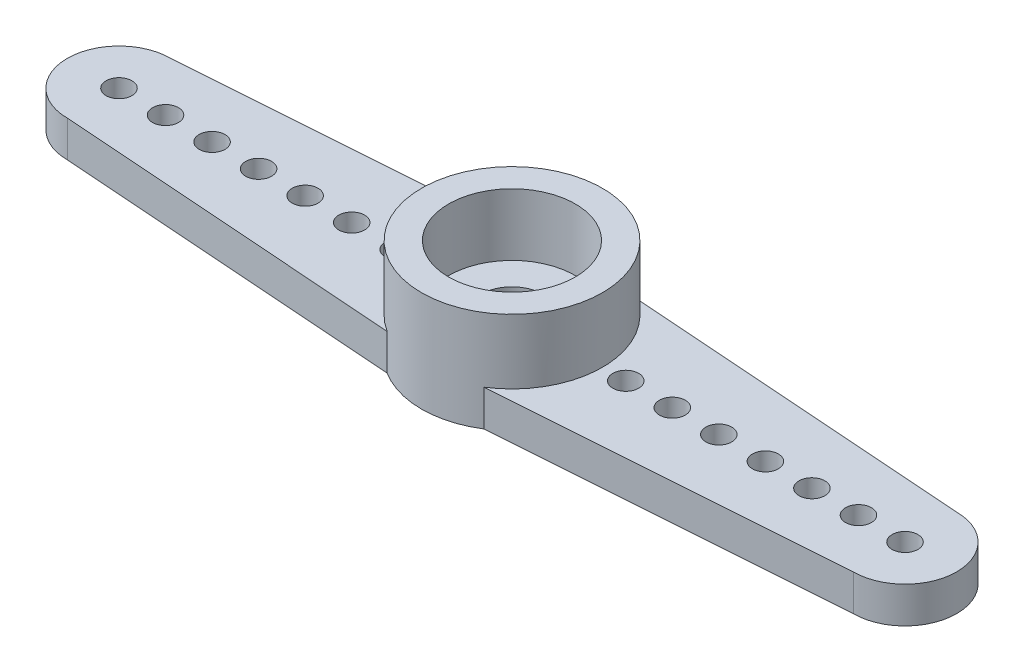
ISO-10303-21;
HEADER;
FILE_DESCRIPTION(('STEP AP214'),'2;1');
FILE_NAME('part.step','',(''),(''),'','','');
FILE_SCHEMA(('AUTOMOTIVE_DESIGN { 1 0 10303 214 1 1 1 1 }'));
ENDSEC;
DATA;
#1=APPLICATION_CONTEXT('core data for automotive mechanical design processes');
#2=APPLICATION_PROTOCOL_DEFINITION('international standard','automotive_design',2000,#1);
#3=PRODUCT_CONTEXT('',#1,'mechanical');
#4=PRODUCT('Part','Part','',(#3));
#5=PRODUCT_RELATED_PRODUCT_CATEGORY('part','',(#4));
#6=PRODUCT_DEFINITION_FORMATION('','',#4);
#7=PRODUCT_DEFINITION_CONTEXT('part definition',#1,'design');
#8=PRODUCT_DEFINITION('design','',#6,#7);
#9=PRODUCT_DEFINITION_SHAPE('','',#8);
#10=(LENGTH_UNIT() NAMED_UNIT(*) SI_UNIT(.MILLI.,.METRE.));
#11=(NAMED_UNIT(*) PLANE_ANGLE_UNIT() SI_UNIT($,.RADIAN.));
#12=(NAMED_UNIT(*) SI_UNIT($,.STERADIAN.) SOLID_ANGLE_UNIT());
#13=UNCERTAINTY_MEASURE_WITH_UNIT(LENGTH_MEASURE(1.E-05),#10,'distance_accuracy_value','');
#14=(GEOMETRIC_REPRESENTATION_CONTEXT(3) GLOBAL_UNCERTAINTY_ASSIGNED_CONTEXT((#13)) GLOBAL_UNIT_ASSIGNED_CONTEXT((#10,
#11,#12)) REPRESENTATION_CONTEXT('',''));
#15=CARTESIAN_POINT('',(0.,0.,0.));
#16=DIRECTION('',(0.,0.,1.));
#17=DIRECTION('',(1.,0.,0.));
#18=AXIS2_PLACEMENT_3D('',#15,#16,#17);
#19=CARTESIAN_POINT('',(-15.2,1.4,0.));
#20=DIRECTION('',(0.,1.,0.));
#21=DIRECTION('',(0.,0.,1.));
#22=AXIS2_PLACEMENT_3D('',#19,#20,#21);
#23=PLANE('',#22);
#24=CARTESIAN_POINT('',(-6.2,1.4,0.));
#25=DIRECTION('',(0.,1.,0.));
#26=DIRECTION('',(0.,0.,1.));
#27=AXIS2_PLACEMENT_3D('',#24,#25,#26);
#28=CIRCLE('',#27,0.500000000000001);
#29=CARTESIAN_POINT('',(-6.2,1.4,0.500000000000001));
#30=VERTEX_POINT('',#29);
#31=EDGE_CURVE('E187',#30,#30,#28,.T.);
#32=ORIENTED_EDGE('',*,*,#31,.F.);
#33=EDGE_LOOP('',(#32));
#34=FACE_BOUND('',#33,.T.);
#35=CARTESIAN_POINT('',(-9.8,1.4,0.));
#36=DIRECTION('',(0.,1.,0.));
#37=DIRECTION('',(0.,0.,1.));
#38=AXIS2_PLACEMENT_3D('',#35,#36,#37);
#39=CIRCLE('',#38,0.500000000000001);
#40=CARTESIAN_POINT('',(-9.8,1.4,0.500000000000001));
#41=VERTEX_POINT('',#40);
#42=EDGE_CURVE('E199',#41,#41,#39,.T.);
#43=ORIENTED_EDGE('',*,*,#42,.F.);
#44=EDGE_LOOP('',(#43));
#45=FACE_BOUND('',#44,.T.);
#46=CARTESIAN_POINT('',(-11.6,1.4,0.));
#47=DIRECTION('',(0.,1.,0.));
#48=DIRECTION('',(0.,0.,1.));
#49=AXIS2_PLACEMENT_3D('',#46,#47,#48);
#50=CIRCLE('',#49,0.499999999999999);
#51=CARTESIAN_POINT('',(-11.6,1.4,0.499999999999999));
#52=VERTEX_POINT('',#51);
#53=EDGE_CURVE('E205',#52,#52,#50,.T.);
#54=ORIENTED_EDGE('',*,*,#53,.F.);
#55=EDGE_LOOP('',(#54));
#56=FACE_BOUND('',#55,.T.);
#57=CARTESIAN_POINT('',(-13.4,1.4,0.));
#58=DIRECTION('',(0.,1.,0.));
#59=DIRECTION('',(0.,0.,1.));
#60=AXIS2_PLACEMENT_3D('',#57,#58,#59);
#61=CIRCLE('',#60,0.500000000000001);
#62=CARTESIAN_POINT('',(-13.4,1.4,0.500000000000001));
#63=VERTEX_POINT('',#62);
#64=EDGE_CURVE('E211',#63,#63,#61,.T.);
#65=ORIENTED_EDGE('',*,*,#64,.F.);
#66=EDGE_LOOP('',(#65));
#67=FACE_BOUND('',#66,.T.);
#68=CARTESIAN_POINT('',(-15.2,1.4,0.));
#69=DIRECTION('',(0.,1.,0.));
#70=DIRECTION('',(0.,0.,1.));
#71=AXIS2_PLACEMENT_3D('',#68,#69,#70);
#72=CIRCLE('',#71,0.500000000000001);
#73=CARTESIAN_POINT('',(-15.2,1.4,0.500000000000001));
#74=VERTEX_POINT('',#73);
#75=EDGE_CURVE('E98',#74,#74,#72,.T.);
#76=ORIENTED_EDGE('',*,*,#75,.F.);
#77=EDGE_LOOP('',(#76));
#78=FACE_BOUND('',#77,.T.);
#79=CARTESIAN_POINT('',(-8.,1.4,0.));
#80=DIRECTION('',(0.,1.,0.));
#81=DIRECTION('',(0.,0.,1.));
#82=AXIS2_PLACEMENT_3D('',#79,#80,#81);
#83=CIRCLE('',#82,0.500000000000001);
#84=CARTESIAN_POINT('',(-8.,1.4,0.500000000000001));
#85=VERTEX_POINT('',#84);
#86=EDGE_CURVE('E193',#85,#85,#83,.T.);
#87=ORIENTED_EDGE('',*,*,#86,.F.);
#88=EDGE_LOOP('',(#87));
#89=FACE_BOUND('',#88,.T.);
#90=CARTESIAN_POINT('',(-4.4,1.4,0.));
#91=DIRECTION('',(0.,1.,0.));
#92=DIRECTION('',(0.,0.,1.));
#93=AXIS2_PLACEMENT_3D('',#90,#91,#92);
#94=CIRCLE('',#93,0.500000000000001);
#95=CARTESIAN_POINT('',(-4.4,1.4,0.500000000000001));
#96=VERTEX_POINT('',#95);
#97=EDGE_CURVE('E181',#96,#96,#94,.T.);
#98=ORIENTED_EDGE('',*,*,#97,.F.);
#99=EDGE_LOOP('',(#98));
#100=FACE_BOUND('',#99,.T.);
#101=DIRECTION('',(0.997420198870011,0.,0.0717840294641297));
#102=VECTOR('',#101,1.);
#103=CARTESIAN_POINT('',(-15.2,1.4,2.));
#104=LINE('',#103,#102);
#105=CARTESIAN_POINT('',(-15.2,1.4,2.));
#106=VERTEX_POINT('',#105);
#107=CARTESIAN_POINT('',(-1.86858471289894,1.4,2.95945791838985));
#108=VERTEX_POINT('',#107);
#109=EDGE_CURVE('E225',#106,#108,#104,.T.);
#110=ORIENTED_EDGE('',*,*,#109,.T.);
#111=CARTESIAN_POINT('',(0.,1.4,0.));
#112=DIRECTION('',(0.,1.,0.));
#113=DIRECTION('',(0.,0.,1.));
#114=AXIS2_PLACEMENT_3D('',#111,#112,#113);
#115=CIRCLE('',#114,3.5);
#116=CARTESIAN_POINT('',(-1.86858471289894,1.4,-2.95945791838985));
#117=VERTEX_POINT('',#116);
#118=EDGE_CURVE('E120',#117,#108,#115,.T.);
#119=ORIENTED_EDGE('',*,*,#118,.F.);
#120=DIRECTION('',(-0.997420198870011,0.,0.0717840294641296));
#121=VECTOR('',#120,1.);
#122=CARTESIAN_POINT('',(-15.2,1.4,-2.));
#123=LINE('',#122,#121);
#124=CARTESIAN_POINT('',(-15.2,1.4,-2.));
#125=VERTEX_POINT('',#124);
#126=EDGE_CURVE('E51',#117,#125,#123,.T.);
#127=ORIENTED_EDGE('',*,*,#126,.T.);
#128=CARTESIAN_POINT('',(-15.2,1.4,0.));
#129=DIRECTION('',(0.,1.,0.));
#130=DIRECTION('',(0.,0.,1.));
#131=AXIS2_PLACEMENT_3D('',#128,#129,#130);
#132=CIRCLE('',#131,2.);
#133=EDGE_CURVE('E84',#125,#106,#132,.T.);
#134=ORIENTED_EDGE('',*,*,#133,.T.);
#135=EDGE_LOOP('',(#110,#119,#127,#134));
#136=FACE_BOUND('',#135,.T.);
#137=ADVANCED_FACE('F34',(#34,#45,#56,#67,#78,#89,#100,#136),#23,.T.);
#138=CARTESIAN_POINT('',(6.2,1.4,0.));
#139=DIRECTION('',(0.,1.,0.));
#140=DIRECTION('',(0.,0.,1.));
#141=AXIS2_PLACEMENT_3D('',#138,#139,#140);
#142=CIRCLE('',#141,0.499999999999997);
#143=CARTESIAN_POINT('',(6.2,1.4,0.500000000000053));
#144=VERTEX_POINT('',#143);
#145=EDGE_CURVE('E151',#144,#144,#142,.T.);
#146=ORIENTED_EDGE('',*,*,#145,.F.);
#147=EDGE_LOOP('',(#146));
#148=FACE_BOUND('',#147,.T.);
#149=CARTESIAN_POINT('',(9.8,1.4,0.));
#150=DIRECTION('',(0.,1.,0.));
#151=DIRECTION('',(0.,0.,1.));
#152=AXIS2_PLACEMENT_3D('',#149,#150,#151);
#153=CIRCLE('',#152,0.499999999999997);
#154=CARTESIAN_POINT('',(9.8,1.4,0.500000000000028));
#155=VERTEX_POINT('',#154);
#156=EDGE_CURVE('E163',#155,#155,#153,.T.);
#157=ORIENTED_EDGE('',*,*,#156,.F.);
#158=EDGE_LOOP('',(#157));
#159=FACE_BOUND('',#158,.T.);
#160=CARTESIAN_POINT('',(13.4,1.4,0.));
#161=DIRECTION('',(0.,1.,0.));
#162=DIRECTION('',(0.,0.,1.));
#163=AXIS2_PLACEMENT_3D('',#160,#161,#162);
#164=CIRCLE('',#163,0.499999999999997);
#165=CARTESIAN_POINT('',(13.4,1.4,0.500000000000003));
#166=VERTEX_POINT('',#165);
#167=EDGE_CURVE('E175',#166,#166,#164,.T.);
#168=ORIENTED_EDGE('',*,*,#167,.F.);
#169=EDGE_LOOP('',(#168));
#170=FACE_BOUND('',#169,.T.);
#171=CARTESIAN_POINT('',(15.2,1.4,0.));
#172=DIRECTION('',(0.,1.,0.));
#173=DIRECTION('',(0.,0.,1.));
#174=AXIS2_PLACEMENT_3D('',#171,#172,#173);
#175=CIRCLE('',#174,0.499999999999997);
#176=CARTESIAN_POINT('',(15.2,1.4,0.49999999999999));
#177=VERTEX_POINT('',#176);
#178=EDGE_CURVE('E217',#177,#177,#175,.T.);
#179=ORIENTED_EDGE('',*,*,#178,.F.);
#180=EDGE_LOOP('',(#179));
#181=FACE_BOUND('',#180,.T.);
#182=CARTESIAN_POINT('',(11.6,1.4,0.));
#183=DIRECTION('',(0.,1.,0.));
#184=DIRECTION('',(0.,0.,1.));
#185=AXIS2_PLACEMENT_3D('',#182,#183,#184);
#186=CIRCLE('',#185,0.499999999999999);
#187=CARTESIAN_POINT('',(11.6,1.4,0.500000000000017));
#188=VERTEX_POINT('',#187);
#189=EDGE_CURVE('E169',#188,#188,#186,.T.);
#190=ORIENTED_EDGE('',*,*,#189,.F.);
#191=EDGE_LOOP('',(#190));
#192=FACE_BOUND('',#191,.T.);
#193=CARTESIAN_POINT('',(8.,1.4,0.));
#194=DIRECTION('',(0.,1.,0.));
#195=DIRECTION('',(0.,0.,1.));
#196=AXIS2_PLACEMENT_3D('',#193,#194,#195);
#197=CIRCLE('',#196,0.499999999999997);
#198=CARTESIAN_POINT('',(8.,1.4,0.500000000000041));
#199=VERTEX_POINT('',#198);
#200=EDGE_CURVE('E157',#199,#199,#197,.T.);
#201=ORIENTED_EDGE('',*,*,#200,.F.);
#202=EDGE_LOOP('',(#201));
#203=FACE_BOUND('',#202,.T.);
#204=CARTESIAN_POINT('',(4.4,1.4,0.));
#205=DIRECTION('',(0.,1.,0.));
#206=DIRECTION('',(0.,0.,1.));
#207=AXIS2_PLACEMENT_3D('',#204,#205,#206);
#208=CIRCLE('',#207,0.499999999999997);
#209=CARTESIAN_POINT('',(4.4,1.4,0.500000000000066));
#210=VERTEX_POINT('',#209);
#211=EDGE_CURVE('E145',#210,#210,#208,.T.);
#212=ORIENTED_EDGE('',*,*,#211,.F.);
#213=EDGE_LOOP('',(#212));
#214=FACE_BOUND('',#213,.T.);
#215=CARTESIAN_POINT('',(1.86858471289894,1.4,2.95945791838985));
#216=VERTEX_POINT('',#215);
#217=CARTESIAN_POINT('',(1.86858471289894,1.4,-2.95945791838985));
#218=VERTEX_POINT('',#217);
#219=EDGE_CURVE('E136',#216,#218,#115,.T.);
#220=ORIENTED_EDGE('',*,*,#219,.F.);
#221=DIRECTION('',(0.997420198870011,0.,-0.0717840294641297));
#222=VECTOR('',#221,1.);
#223=CARTESIAN_POINT('',(-14.9001527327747,1.4,4.16629887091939));
#224=LINE('',#223,#222);
#225=CARTESIAN_POINT('',(15.2,1.4,2.));
#226=VERTEX_POINT('',#225);
#227=EDGE_CURVE('E123',#216,#226,#224,.T.);
#228=ORIENTED_EDGE('',*,*,#227,.T.);
#229=CARTESIAN_POINT('',(15.2,1.4,0.));
#230=DIRECTION('',(0.,1.,0.));
#231=DIRECTION('',(0.,0.,-1.));
#232=AXIS2_PLACEMENT_3D('',#229,#230,#231);
#233=CIRCLE('',#232,2.);
#234=CARTESIAN_POINT('',(15.2,1.4,-2.));
#235=VERTEX_POINT('',#234);
#236=EDGE_CURVE('E227',#226,#235,#233,.T.);
#237=ORIENTED_EDGE('',*,*,#236,.T.);
#238=DIRECTION('',(-0.997420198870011,0.,-0.0717840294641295));
#239=VECTOR('',#238,1.);
#240=CARTESIAN_POINT('',(-14.9001527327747,1.4,-4.16629887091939));
#241=LINE('',#240,#239);
#242=EDGE_CURVE('E128',#235,#218,#241,.T.);
#243=ORIENTED_EDGE('',*,*,#242,.T.);
#244=EDGE_LOOP('',(#220,#228,#237,#243));
#245=FACE_BOUND('',#244,.T.);
#246=ADVANCED_FACE('F235',(#148,#159,#170,#181,#192,#203,#214,#245),#23,.T.);
#247=CARTESIAN_POINT('',(-15.2,0.,0.));
#248=DIRECTION('',(0.,1.,0.));
#249=DIRECTION('',(0.,0.,1.));
#250=AXIS2_PLACEMENT_3D('',#247,#248,#249);
#251=PLANE('',#250);
#252=CARTESIAN_POINT('',(0.,0.,0.));
#253=DIRECTION('',(0.,-1.,0.));
#254=DIRECTION('',(0.,0.,-1.));
#255=AXIS2_PLACEMENT_3D('',#252,#253,#254);
#256=CIRCLE('',#255,2.35);
#257=CARTESIAN_POINT('',(0.,0.,-2.35));
#258=VERTEX_POINT('',#257);
#259=EDGE_CURVE('E135',#258,#258,#256,.T.);
#260=ORIENTED_EDGE('',*,*,#259,.F.);
#261=EDGE_LOOP('',(#260));
#262=FACE_BOUND('',#261,.T.);
#263=CARTESIAN_POINT('',(-15.2,0.,0.));
#264=DIRECTION('',(0.,1.,0.));
#265=DIRECTION('',(0.,0.,1.));
#266=AXIS2_PLACEMENT_3D('',#263,#264,#265);
#267=CIRCLE('',#266,0.500000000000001);
#268=CARTESIAN_POINT('',(-15.2,0.,0.500000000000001));
#269=VERTEX_POINT('',#268);
#270=EDGE_CURVE('E102',#269,#269,#267,.T.);
#271=ORIENTED_EDGE('',*,*,#270,.T.);
#272=EDGE_LOOP('',(#271));
#273=FACE_BOUND('',#272,.T.);
#274=CARTESIAN_POINT('',(15.2,0.,0.));
#275=DIRECTION('',(0.,1.,0.));
#276=DIRECTION('',(0.,0.,1.));
#277=AXIS2_PLACEMENT_3D('',#274,#275,#276);
#278=CIRCLE('',#277,0.499999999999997);
#279=CARTESIAN_POINT('',(15.2,0.,0.49999999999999));
#280=VERTEX_POINT('',#279);
#281=EDGE_CURVE('E214',#280,#280,#278,.T.);
#282=ORIENTED_EDGE('',*,*,#281,.T.);
#283=EDGE_LOOP('',(#282));
#284=FACE_BOUND('',#283,.T.);
#285=CARTESIAN_POINT('',(-13.4,0.,0.));
#286=DIRECTION('',(0.,1.,0.));
#287=DIRECTION('',(0.,0.,1.));
#288=AXIS2_PLACEMENT_3D('',#285,#286,#287);
#289=CIRCLE('',#288,0.500000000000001);
#290=CARTESIAN_POINT('',(-13.4,0.,0.500000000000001));
#291=VERTEX_POINT('',#290);
#292=EDGE_CURVE('E208',#291,#291,#289,.T.);
#293=ORIENTED_EDGE('',*,*,#292,.T.);
#294=EDGE_LOOP('',(#293));
#295=FACE_BOUND('',#294,.T.);
#296=CARTESIAN_POINT('',(-11.6,0.,0.));
#297=DIRECTION('',(0.,1.,0.));
#298=DIRECTION('',(0.,0.,1.));
#299=AXIS2_PLACEMENT_3D('',#296,#297,#298);
#300=CIRCLE('',#299,0.499999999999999);
#301=CARTESIAN_POINT('',(-11.6,0.,0.499999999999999));
#302=VERTEX_POINT('',#301);
#303=EDGE_CURVE('E202',#302,#302,#300,.T.);
#304=ORIENTED_EDGE('',*,*,#303,.T.);
#305=EDGE_LOOP('',(#304));
#306=FACE_BOUND('',#305,.T.);
#307=CARTESIAN_POINT('',(-9.8,0.,0.));
#308=DIRECTION('',(0.,1.,0.));
#309=DIRECTION('',(0.,0.,1.));
#310=AXIS2_PLACEMENT_3D('',#307,#308,#309);
#311=CIRCLE('',#310,0.500000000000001);
#312=CARTESIAN_POINT('',(-9.8,0.,0.500000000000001));
#313=VERTEX_POINT('',#312);
#314=EDGE_CURVE('E196',#313,#313,#311,.T.);
#315=ORIENTED_EDGE('',*,*,#314,.T.);
#316=EDGE_LOOP('',(#315));
#317=FACE_BOUND('',#316,.T.);
#318=CARTESIAN_POINT('',(-8.,0.,0.));
#319=DIRECTION('',(0.,1.,0.));
#320=DIRECTION('',(0.,0.,1.));
#321=AXIS2_PLACEMENT_3D('',#318,#319,#320);
#322=CIRCLE('',#321,0.500000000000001);
#323=CARTESIAN_POINT('',(-8.,0.,0.500000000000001));
#324=VERTEX_POINT('',#323);
#325=EDGE_CURVE('E190',#324,#324,#322,.T.);
#326=ORIENTED_EDGE('',*,*,#325,.T.);
#327=EDGE_LOOP('',(#326));
#328=FACE_BOUND('',#327,.T.);
#329=CARTESIAN_POINT('',(-6.2,0.,0.));
#330=DIRECTION('',(0.,1.,0.));
#331=DIRECTION('',(0.,0.,1.));
#332=AXIS2_PLACEMENT_3D('',#329,#330,#331);
#333=CIRCLE('',#332,0.500000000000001);
#334=CARTESIAN_POINT('',(-6.2,0.,0.500000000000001));
#335=VERTEX_POINT('',#334);
#336=EDGE_CURVE('E184',#335,#335,#333,.T.);
#337=ORIENTED_EDGE('',*,*,#336,.T.);
#338=EDGE_LOOP('',(#337));
#339=FACE_BOUND('',#338,.T.);
#340=CARTESIAN_POINT('',(-4.4,0.,0.));
#341=DIRECTION('',(0.,1.,0.));
#342=DIRECTION('',(0.,0.,1.));
#343=AXIS2_PLACEMENT_3D('',#340,#341,#342);
#344=CIRCLE('',#343,0.500000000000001);
#345=CARTESIAN_POINT('',(-4.4,0.,0.500000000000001));
#346=VERTEX_POINT('',#345);
#347=EDGE_CURVE('E178',#346,#346,#344,.T.);
#348=ORIENTED_EDGE('',*,*,#347,.T.);
#349=EDGE_LOOP('',(#348));
#350=FACE_BOUND('',#349,.T.);
#351=CARTESIAN_POINT('',(13.4,0.,0.));
#352=DIRECTION('',(0.,1.,0.));
#353=DIRECTION('',(0.,0.,1.));
#354=AXIS2_PLACEMENT_3D('',#351,#352,#353);
#355=CIRCLE('',#354,0.499999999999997);
#356=CARTESIAN_POINT('',(13.4,0.,0.500000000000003));
#357=VERTEX_POINT('',#356);
#358=EDGE_CURVE('E172',#357,#357,#355,.T.);
#359=ORIENTED_EDGE('',*,*,#358,.T.);
#360=EDGE_LOOP('',(#359));
#361=FACE_BOUND('',#360,.T.);
#362=CARTESIAN_POINT('',(11.6,0.,0.));
#363=DIRECTION('',(0.,1.,0.));
#364=DIRECTION('',(0.,0.,1.));
#365=AXIS2_PLACEMENT_3D('',#362,#363,#364);
#366=CIRCLE('',#365,0.499999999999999);
#367=CARTESIAN_POINT('',(11.6,0.,0.500000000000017));
#368=VERTEX_POINT('',#367);
#369=EDGE_CURVE('E166',#368,#368,#366,.T.);
#370=ORIENTED_EDGE('',*,*,#369,.T.);
#371=EDGE_LOOP('',(#370));
#372=FACE_BOUND('',#371,.T.);
#373=CARTESIAN_POINT('',(9.8,0.,0.));
#374=DIRECTION('',(0.,1.,0.));
#375=DIRECTION('',(0.,0.,1.));
#376=AXIS2_PLACEMENT_3D('',#373,#374,#375);
#377=CIRCLE('',#376,0.499999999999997);
#378=CARTESIAN_POINT('',(9.8,0.,0.500000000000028));
#379=VERTEX_POINT('',#378);
#380=EDGE_CURVE('E160',#379,#379,#377,.T.);
#381=ORIENTED_EDGE('',*,*,#380,.T.);
#382=EDGE_LOOP('',(#381));
#383=FACE_BOUND('',#382,.T.);
#384=CARTESIAN_POINT('',(8.,0.,0.));
#385=DIRECTION('',(0.,1.,0.));
#386=DIRECTION('',(0.,0.,1.));
#387=AXIS2_PLACEMENT_3D('',#384,#385,#386);
#388=CIRCLE('',#387,0.499999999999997);
#389=CARTESIAN_POINT('',(8.,0.,0.500000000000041));
#390=VERTEX_POINT('',#389);
#391=EDGE_CURVE('E154',#390,#390,#388,.T.);
#392=ORIENTED_EDGE('',*,*,#391,.T.);
#393=EDGE_LOOP('',(#392));
#394=FACE_BOUND('',#393,.T.);
#395=CARTESIAN_POINT('',(6.2,0.,0.));
#396=DIRECTION('',(0.,1.,0.));
#397=DIRECTION('',(0.,0.,1.));
#398=AXIS2_PLACEMENT_3D('',#395,#396,#397);
#399=CIRCLE('',#398,0.499999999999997);
#400=CARTESIAN_POINT('',(6.2,0.,0.500000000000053));
#401=VERTEX_POINT('',#400);
#402=EDGE_CURVE('E148',#401,#401,#399,.T.);
#403=ORIENTED_EDGE('',*,*,#402,.T.);
#404=EDGE_LOOP('',(#403));
#405=FACE_BOUND('',#404,.T.);
#406=CARTESIAN_POINT('',(4.4,0.,0.));
#407=DIRECTION('',(0.,1.,0.));
#408=DIRECTION('',(0.,0.,1.));
#409=AXIS2_PLACEMENT_3D('',#406,#407,#408);
#410=CIRCLE('',#409,0.499999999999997);
#411=CARTESIAN_POINT('',(4.4,0.,0.500000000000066));
#412=VERTEX_POINT('',#411);
#413=EDGE_CURVE('E142',#412,#412,#410,.T.);
#414=ORIENTED_EDGE('',*,*,#413,.T.);
#415=EDGE_LOOP('',(#414));
#416=FACE_BOUND('',#415,.T.);
#417=CARTESIAN_POINT('',(0.,0.,0.));
#418=DIRECTION('',(0.,-1.,0.));
#419=DIRECTION('',(0.,0.,-1.));
#420=AXIS2_PLACEMENT_3D('',#417,#418,#419);
#421=CIRCLE('',#420,3.5);
#422=CARTESIAN_POINT('',(1.86858471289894,0.,2.95945791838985));
#423=VERTEX_POINT('',#422);
#424=CARTESIAN_POINT('',(-1.86858471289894,0.,2.95945791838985));
#425=VERTEX_POINT('',#424);
#426=EDGE_CURVE('E257',#423,#425,#421,.T.);
#427=ORIENTED_EDGE('',*,*,#426,.T.);
#428=DIRECTION('',(0.997420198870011,0.,0.0717840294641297));
#429=VECTOR('',#428,1.);
#430=CARTESIAN_POINT('',(-15.2,0.,2.));
#431=LINE('',#430,#429);
#432=CARTESIAN_POINT('',(-15.2,0.,2.));
#433=VERTEX_POINT('',#432);
#434=EDGE_CURVE('E96',#433,#425,#431,.T.);
#435=ORIENTED_EDGE('',*,*,#434,.F.);
#436=CARTESIAN_POINT('',(-15.2,0.,0.));
#437=DIRECTION('',(0.,1.,0.));
#438=DIRECTION('',(0.,0.,1.));
#439=AXIS2_PLACEMENT_3D('',#436,#437,#438);
#440=CIRCLE('',#439,2.);
#441=CARTESIAN_POINT('',(-15.2,0.,-2.));
#442=VERTEX_POINT('',#441);
#443=EDGE_CURVE('E90',#442,#433,#440,.T.);
#444=ORIENTED_EDGE('',*,*,#443,.F.);
#445=DIRECTION('',(-0.997420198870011,0.,0.0717840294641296));
#446=VECTOR('',#445,1.);
#447=CARTESIAN_POINT('',(-15.2,0.,-2.));
#448=LINE('',#447,#446);
#449=CARTESIAN_POINT('',(-1.86858471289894,0.,-2.95945791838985));
#450=VERTEX_POINT('',#449);
#451=EDGE_CURVE('E72',#450,#442,#448,.T.);
#452=ORIENTED_EDGE('',*,*,#451,.F.);
#453=CARTESIAN_POINT('',(0.,0.,0.));
#454=DIRECTION('',(0.,-1.,0.));
#455=DIRECTION('',(0.,0.,-1.));
#456=AXIS2_PLACEMENT_3D('',#453,#454,#455);
#457=CIRCLE('',#456,3.5);
#458=CARTESIAN_POINT('',(1.86858471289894,0.,-2.95945791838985));
#459=VERTEX_POINT('',#458);
#460=EDGE_CURVE('E255',#450,#459,#457,.T.);
#461=ORIENTED_EDGE('',*,*,#460,.T.);
#462=DIRECTION('',(0.997420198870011,0.,0.0717840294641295));
#463=VECTOR('',#462,1.);
#464=CARTESIAN_POINT('',(1.86858471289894,0.,-2.95945791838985));
#465=LINE('',#464,#463);
#466=CARTESIAN_POINT('',(15.2,0.,-2.));
#467=VERTEX_POINT('',#466);
#468=EDGE_CURVE('E252',#459,#467,#465,.T.);
#469=ORIENTED_EDGE('',*,*,#468,.T.);
#470=CARTESIAN_POINT('',(15.2,0.,0.));
#471=DIRECTION('',(0.,1.,0.));
#472=DIRECTION('',(0.,0.,-1.));
#473=AXIS2_PLACEMENT_3D('',#470,#471,#472);
#474=CIRCLE('',#473,2.);
#475=CARTESIAN_POINT('',(15.2,0.,1.99999999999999));
#476=VERTEX_POINT('',#475);
#477=EDGE_CURVE('E85',#476,#467,#474,.T.);
#478=ORIENTED_EDGE('',*,*,#477,.F.);
#479=DIRECTION('',(-0.997420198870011,0.,0.0717840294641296));
#480=VECTOR('',#479,1.);
#481=CARTESIAN_POINT('',(15.2,0.,2.));
#482=LINE('',#481,#480);
#483=EDGE_CURVE('E66',#476,#423,#482,.T.);
#484=ORIENTED_EDGE('',*,*,#483,.T.);
#485=EDGE_LOOP('',(#427,#435,#444,#452,#461,#469,#478,#484));
#486=FACE_BOUND('',#485,.T.);
#487=ADVANCED_FACE('F94',(#262,#273,#284,#295,#306,#317,#328,#339,#350,#361,#372,#383,#394,#405,
#416,#486),#251,.F.);
#488=CARTESIAN_POINT('',(-15.2,1.4,0.));
#489=DIRECTION('',(0.,-1.,0.));
#490=DIRECTION('',(0.,0.,-1.));
#491=AXIS2_PLACEMENT_3D('',#488,#489,#490);
#492=CYLINDRICAL_SURFACE('',#491,2.);
#493=ORIENTED_EDGE('',*,*,#443,.T.);
#494=DIRECTION('',(0.,-1.,0.));
#495=VECTOR('',#494,1.);
#496=CARTESIAN_POINT('',(-15.2,1.4,2.));
#497=LINE('',#496,#495);
#498=EDGE_CURVE('E43',#106,#433,#497,.T.);
#499=ORIENTED_EDGE('',*,*,#498,.F.);
#500=ORIENTED_EDGE('',*,*,#133,.F.);
#501=DIRECTION('',(0.,-1.,0.));
#502=VECTOR('',#501,1.);
#503=CARTESIAN_POINT('',(-15.2,1.4,-2.));
#504=LINE('',#503,#502);
#505=EDGE_CURVE('E75',#125,#442,#504,.T.);
#506=ORIENTED_EDGE('',*,*,#505,.T.);
#507=EDGE_LOOP('',(#493,#499,#500,#506));
#508=FACE_BOUND('',#507,.T.);
#509=ADVANCED_FACE('F36',(#508),#492,.T.);
#510=CARTESIAN_POINT('',(-15.2,1.4,2.));
#511=DIRECTION('',(0.0717840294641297,0.,-0.997420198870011));
#512=DIRECTION('',(-0.997420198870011,0.,-0.0717840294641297));
#513=AXIS2_PLACEMENT_3D('',#510,#511,#512);
#514=PLANE('',#513);
#515=ORIENTED_EDGE('',*,*,#434,.T.);
#516=DIRECTION('',(0.,-1.,0.));
#517=VECTOR('',#516,1.);
#518=CARTESIAN_POINT('',(-1.86858471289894,3.9,2.95945791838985));
#519=LINE('',#518,#517);
#520=EDGE_CURVE('E262',#108,#425,#519,.T.);
#521=ORIENTED_EDGE('',*,*,#520,.F.);
#522=ORIENTED_EDGE('',*,*,#109,.F.);
#523=ORIENTED_EDGE('',*,*,#498,.T.);
#524=EDGE_LOOP('',(#515,#521,#522,#523));
#525=FACE_BOUND('',#524,.T.);
#526=ADVANCED_FACE('F283',(#525),#514,.F.);
#527=CARTESIAN_POINT('',(15.2,1.4,0.));
#528=DIRECTION('',(0.,-1.,0.));
#529=DIRECTION('',(0.,0.,-1.));
#530=AXIS2_PLACEMENT_3D('',#527,#528,#529);
#531=CYLINDRICAL_SURFACE('',#530,2.);
#532=ORIENTED_EDGE('',*,*,#477,.T.);
#533=DIRECTION('',(0.,-1.,0.));
#534=VECTOR('',#533,1.);
#535=CARTESIAN_POINT('',(15.2,1.4,-2.00000000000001));
#536=LINE('',#535,#534);
#537=EDGE_CURVE('E91',#235,#467,#536,.T.);
#538=ORIENTED_EDGE('',*,*,#537,.F.);
#539=ORIENTED_EDGE('',*,*,#236,.F.);
#540=DIRECTION('',(0.,-1.,0.));
#541=VECTOR('',#540,1.);
#542=CARTESIAN_POINT('',(15.2,1.4,1.99999999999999));
#543=LINE('',#542,#541);
#544=EDGE_CURVE('E111',#226,#476,#543,.T.);
#545=ORIENTED_EDGE('',*,*,#544,.T.);
#546=EDGE_LOOP('',(#532,#538,#539,#545));
#547=FACE_BOUND('',#546,.T.);
#548=ADVANCED_FACE('F243',(#547),#531,.T.);
#549=CARTESIAN_POINT('',(-15.2,1.4,-2.));
#550=DIRECTION('',(0.0717840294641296,0.,0.997420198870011));
#551=DIRECTION('',(0.997420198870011,0.,-0.0717840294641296));
#552=AXIS2_PLACEMENT_3D('',#549,#550,#551);
#553=PLANE('',#552);
#554=ORIENTED_EDGE('',*,*,#451,.T.);
#555=ORIENTED_EDGE('',*,*,#505,.F.);
#556=ORIENTED_EDGE('',*,*,#126,.F.);
#557=DIRECTION('',(0.,-1.,0.));
#558=VECTOR('',#557,1.);
#559=CARTESIAN_POINT('',(-1.86858471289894,3.9,-2.95945791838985));
#560=LINE('',#559,#558);
#561=EDGE_CURVE('E79',#117,#450,#560,.T.);
#562=ORIENTED_EDGE('',*,*,#561,.T.);
#563=EDGE_LOOP('',(#554,#555,#556,#562));
#564=FACE_BOUND('',#563,.T.);
#565=ADVANCED_FACE('F74',(#564),#553,.F.);
#566=CARTESIAN_POINT('',(-15.2,1.4,0.));
#567=DIRECTION('',(0.,-1.,0.));
#568=DIRECTION('',(0.,0.,-1.));
#569=AXIS2_PLACEMENT_3D('',#566,#567,#568);
#570=CYLINDRICAL_SURFACE('',#569,0.500000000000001);
#571=ORIENTED_EDGE('',*,*,#75,.T.);
#572=EDGE_LOOP('',(#571));
#573=FACE_BOUND('',#572,.T.);
#574=ORIENTED_EDGE('',*,*,#270,.F.);
#575=EDGE_LOOP('',(#574));
#576=FACE_BOUND('',#575,.T.);
#577=ADVANCED_FACE('F308',(#573,#576),#570,.F.);
#578=CARTESIAN_POINT('',(15.2,1.4,0.));
#579=DIRECTION('',(0.,-1.,0.));
#580=DIRECTION('',(0.,0.,-1.));
#581=AXIS2_PLACEMENT_3D('',#578,#579,#580);
#582=CYLINDRICAL_SURFACE('',#581,0.499999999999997);
#583=ORIENTED_EDGE('',*,*,#178,.T.);
#584=EDGE_LOOP('',(#583));
#585=FACE_BOUND('',#584,.T.);
#586=ORIENTED_EDGE('',*,*,#281,.F.);
#587=EDGE_LOOP('',(#586));
#588=FACE_BOUND('',#587,.T.);
#589=ADVANCED_FACE('F510',(#585,#588),#582,.F.);
#590=CARTESIAN_POINT('',(-13.4,1.4,0.));
#591=DIRECTION('',(0.,-1.,0.));
#592=DIRECTION('',(0.,0.,-1.));
#593=AXIS2_PLACEMENT_3D('',#590,#591,#592);
#594=CYLINDRICAL_SURFACE('',#593,0.500000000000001);
#595=ORIENTED_EDGE('',*,*,#64,.T.);
#596=EDGE_LOOP('',(#595));
#597=FACE_BOUND('',#596,.T.);
#598=ORIENTED_EDGE('',*,*,#292,.F.);
#599=EDGE_LOOP('',(#598));
#600=FACE_BOUND('',#599,.T.);
#601=ADVANCED_FACE('F500',(#597,#600),#594,.F.);
#602=CARTESIAN_POINT('',(-11.6,1.4,0.));
#603=DIRECTION('',(0.,-1.,0.));
#604=DIRECTION('',(0.,0.,-1.));
#605=AXIS2_PLACEMENT_3D('',#602,#603,#604);
#606=CYLINDRICAL_SURFACE('',#605,0.499999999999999);
#607=ORIENTED_EDGE('',*,*,#53,.T.);
#608=EDGE_LOOP('',(#607));
#609=FACE_BOUND('',#608,.T.);
#610=ORIENTED_EDGE('',*,*,#303,.F.);
#611=EDGE_LOOP('',(#610));
#612=FACE_BOUND('',#611,.T.);
#613=ADVANCED_FACE('F490',(#609,#612),#606,.F.);
#614=CARTESIAN_POINT('',(-9.8,1.4,0.));
#615=DIRECTION('',(0.,-1.,0.));
#616=DIRECTION('',(0.,0.,-1.));
#617=AXIS2_PLACEMENT_3D('',#614,#615,#616);
#618=CYLINDRICAL_SURFACE('',#617,0.500000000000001);
#619=ORIENTED_EDGE('',*,*,#42,.T.);
#620=EDGE_LOOP('',(#619));
#621=FACE_BOUND('',#620,.T.);
#622=ORIENTED_EDGE('',*,*,#314,.F.);
#623=EDGE_LOOP('',(#622));
#624=FACE_BOUND('',#623,.T.);
#625=ADVANCED_FACE('F480',(#621,#624),#618,.F.);
#626=CARTESIAN_POINT('',(-8.,1.4,0.));
#627=DIRECTION('',(0.,-1.,0.));
#628=DIRECTION('',(0.,0.,-1.));
#629=AXIS2_PLACEMENT_3D('',#626,#627,#628);
#630=CYLINDRICAL_SURFACE('',#629,0.500000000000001);
#631=ORIENTED_EDGE('',*,*,#86,.T.);
#632=EDGE_LOOP('',(#631));
#633=FACE_BOUND('',#632,.T.);
#634=ORIENTED_EDGE('',*,*,#325,.F.);
#635=EDGE_LOOP('',(#634));
#636=FACE_BOUND('',#635,.T.);
#637=ADVANCED_FACE('F470',(#633,#636),#630,.F.);
#638=CARTESIAN_POINT('',(-6.2,1.4,0.));
#639=DIRECTION('',(0.,-1.,0.));
#640=DIRECTION('',(0.,0.,-1.));
#641=AXIS2_PLACEMENT_3D('',#638,#639,#640);
#642=CYLINDRICAL_SURFACE('',#641,0.500000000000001);
#643=ORIENTED_EDGE('',*,*,#31,.T.);
#644=EDGE_LOOP('',(#643));
#645=FACE_BOUND('',#644,.T.);
#646=ORIENTED_EDGE('',*,*,#336,.F.);
#647=EDGE_LOOP('',(#646));
#648=FACE_BOUND('',#647,.T.);
#649=ADVANCED_FACE('F460',(#645,#648),#642,.F.);
#650=CARTESIAN_POINT('',(-4.4,1.4,0.));
#651=DIRECTION('',(0.,-1.,0.));
#652=DIRECTION('',(0.,0.,-1.));
#653=AXIS2_PLACEMENT_3D('',#650,#651,#652);
#654=CYLINDRICAL_SURFACE('',#653,0.500000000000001);
#655=ORIENTED_EDGE('',*,*,#97,.T.);
#656=EDGE_LOOP('',(#655));
#657=FACE_BOUND('',#656,.T.);
#658=ORIENTED_EDGE('',*,*,#347,.F.);
#659=EDGE_LOOP('',(#658));
#660=FACE_BOUND('',#659,.T.);
#661=ADVANCED_FACE('F450',(#657,#660),#654,.F.);
#662=CARTESIAN_POINT('',(13.4,1.4,0.));
#663=DIRECTION('',(0.,-1.,0.));
#664=DIRECTION('',(0.,0.,-1.));
#665=AXIS2_PLACEMENT_3D('',#662,#663,#664);
#666=CYLINDRICAL_SURFACE('',#665,0.499999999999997);
#667=ORIENTED_EDGE('',*,*,#167,.T.);
#668=EDGE_LOOP('',(#667));
#669=FACE_BOUND('',#668,.T.);
#670=ORIENTED_EDGE('',*,*,#358,.F.);
#671=EDGE_LOOP('',(#670));
#672=FACE_BOUND('',#671,.T.);
#673=ADVANCED_FACE('F440',(#669,#672),#666,.F.);
#674=CARTESIAN_POINT('',(11.6,1.4,0.));
#675=DIRECTION('',(0.,-1.,0.));
#676=DIRECTION('',(0.,0.,-1.));
#677=AXIS2_PLACEMENT_3D('',#674,#675,#676);
#678=CYLINDRICAL_SURFACE('',#677,0.499999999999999);
#679=ORIENTED_EDGE('',*,*,#189,.T.);
#680=EDGE_LOOP('',(#679));
#681=FACE_BOUND('',#680,.T.);
#682=ORIENTED_EDGE('',*,*,#369,.F.);
#683=EDGE_LOOP('',(#682));
#684=FACE_BOUND('',#683,.T.);
#685=ADVANCED_FACE('F430',(#681,#684),#678,.F.);
#686=CARTESIAN_POINT('',(9.8,1.4,0.));
#687=DIRECTION('',(0.,-1.,0.));
#688=DIRECTION('',(0.,0.,-1.));
#689=AXIS2_PLACEMENT_3D('',#686,#687,#688);
#690=CYLINDRICAL_SURFACE('',#689,0.499999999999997);
#691=ORIENTED_EDGE('',*,*,#156,.T.);
#692=EDGE_LOOP('',(#691));
#693=FACE_BOUND('',#692,.T.);
#694=ORIENTED_EDGE('',*,*,#380,.F.);
#695=EDGE_LOOP('',(#694));
#696=FACE_BOUND('',#695,.T.);
#697=ADVANCED_FACE('F420',(#693,#696),#690,.F.);
#698=CARTESIAN_POINT('',(8.,1.4,0.));
#699=DIRECTION('',(0.,-1.,0.));
#700=DIRECTION('',(0.,0.,-1.));
#701=AXIS2_PLACEMENT_3D('',#698,#699,#700);
#702=CYLINDRICAL_SURFACE('',#701,0.499999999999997);
#703=ORIENTED_EDGE('',*,*,#200,.T.);
#704=EDGE_LOOP('',(#703));
#705=FACE_BOUND('',#704,.T.);
#706=ORIENTED_EDGE('',*,*,#391,.F.);
#707=EDGE_LOOP('',(#706));
#708=FACE_BOUND('',#707,.T.);
#709=ADVANCED_FACE('F410',(#705,#708),#702,.F.);
#710=CARTESIAN_POINT('',(6.2,1.4,0.));
#711=DIRECTION('',(0.,-1.,0.));
#712=DIRECTION('',(0.,0.,-1.));
#713=AXIS2_PLACEMENT_3D('',#710,#711,#712);
#714=CYLINDRICAL_SURFACE('',#713,0.499999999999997);
#715=ORIENTED_EDGE('',*,*,#145,.T.);
#716=EDGE_LOOP('',(#715));
#717=FACE_BOUND('',#716,.T.);
#718=ORIENTED_EDGE('',*,*,#402,.F.);
#719=EDGE_LOOP('',(#718));
#720=FACE_BOUND('',#719,.T.);
#721=ADVANCED_FACE('F400',(#717,#720),#714,.F.);
#722=CARTESIAN_POINT('',(4.4,1.4,0.));
#723=DIRECTION('',(0.,-1.,0.));
#724=DIRECTION('',(0.,0.,-1.));
#725=AXIS2_PLACEMENT_3D('',#722,#723,#724);
#726=CYLINDRICAL_SURFACE('',#725,0.499999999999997);
#727=ORIENTED_EDGE('',*,*,#211,.T.);
#728=EDGE_LOOP('',(#727));
#729=FACE_BOUND('',#728,.T.);
#730=ORIENTED_EDGE('',*,*,#413,.F.);
#731=EDGE_LOOP('',(#730));
#732=FACE_BOUND('',#731,.T.);
#733=ADVANCED_FACE('F390',(#729,#732),#726,.F.);
#734=CARTESIAN_POINT('',(0.,1.,0.));
#735=DIRECTION('',(0.,-1.,0.));
#736=DIRECTION('',(0.,0.,-1.));
#737=AXIS2_PLACEMENT_3D('',#734,#735,#736);
#738=CYLINDRICAL_SURFACE('',#737,2.35);
#739=CARTESIAN_POINT('',(0.,1.,0.));
#740=DIRECTION('',(0.,-1.,0.));
#741=DIRECTION('',(0.,0.,-1.));
#742=AXIS2_PLACEMENT_3D('',#739,#740,#741);
#743=CIRCLE('',#742,2.35);
#744=CARTESIAN_POINT('',(0.,1.,-2.35));
#745=VERTEX_POINT('',#744);
#746=EDGE_CURVE('E139',#745,#745,#743,.T.);
#747=ORIENTED_EDGE('',*,*,#746,.F.);
#748=EDGE_LOOP('',(#747));
#749=FACE_BOUND('',#748,.T.);
#750=ORIENTED_EDGE('',*,*,#259,.T.);
#751=EDGE_LOOP('',(#750));
#752=FACE_BOUND('',#751,.T.);
#753=ADVANCED_FACE('F378',(#749,#752),#738,.F.);
#754=CARTESIAN_POINT('',(0.,1.,0.));
#755=DIRECTION('',(0.,-1.,0.));
#756=DIRECTION('',(0.,0.,-1.));
#757=AXIS2_PLACEMENT_3D('',#754,#755,#756);
#758=PLANE('',#757);
#759=CARTESIAN_POINT('',(0.,1.,0.));
#760=DIRECTION('',(0.,-1.,0.));
#761=DIRECTION('',(0.,0.,-1.));
#762=AXIS2_PLACEMENT_3D('',#759,#760,#761);
#763=CIRCLE('',#762,1.2);
#764=CARTESIAN_POINT('',(0.,1.,-1.2));
#765=VERTEX_POINT('',#764);
#766=EDGE_CURVE('E113',#765,#765,#763,.T.);
#767=ORIENTED_EDGE('',*,*,#766,.F.);
#768=EDGE_LOOP('',(#767));
#769=FACE_BOUND('',#768,.T.);
#770=ORIENTED_EDGE('',*,*,#746,.T.);
#771=EDGE_LOOP('',(#770));
#772=FACE_BOUND('',#771,.T.);
#773=ADVANCED_FACE('F372',(#769,#772),#758,.T.);
#774=CARTESIAN_POINT('',(0.,3.9,0.));
#775=DIRECTION('',(0.,1.,0.));
#776=DIRECTION('',(0.,0.,1.));
#777=AXIS2_PLACEMENT_3D('',#774,#775,#776);
#778=PLANE('',#777);
#779=CARTESIAN_POINT('',(0.,3.9,0.));
#780=DIRECTION('',(0.,1.,0.));
#781=DIRECTION('',(0.,0.,1.));
#782=AXIS2_PLACEMENT_3D('',#779,#780,#781);
#783=CIRCLE('',#782,3.5);
#784=CARTESIAN_POINT('',(0.,3.9,3.5));
#785=VERTEX_POINT('',#784);
#786=EDGE_CURVE('E132',#785,#785,#783,.T.);
#787=ORIENTED_EDGE('',*,*,#786,.T.);
#788=EDGE_LOOP('',(#787));
#789=FACE_BOUND('',#788,.T.);
#790=CARTESIAN_POINT('',(0.,3.9,0.));
#791=DIRECTION('',(0.,1.,0.));
#792=DIRECTION('',(0.,0.,1.));
#793=AXIS2_PLACEMENT_3D('',#790,#791,#792);
#794=CIRCLE('',#793,2.45);
#795=CARTESIAN_POINT('',(0.,3.9,2.45));
#796=VERTEX_POINT('',#795);
#797=EDGE_CURVE('E115',#796,#796,#794,.T.);
#798=ORIENTED_EDGE('',*,*,#797,.F.);
#799=EDGE_LOOP('',(#798));
#800=FACE_BOUND('',#799,.T.);
#801=ADVANCED_FACE('F377',(#789,#800),#778,.T.);
#802=CARTESIAN_POINT('',(0.,3.9,0.));
#803=DIRECTION('',(0.,-1.,0.));
#804=DIRECTION('',(0.,0.,-1.));
#805=AXIS2_PLACEMENT_3D('',#802,#803,#804);
#806=CYLINDRICAL_SURFACE('',#805,3.5);
#807=ORIENTED_EDGE('',*,*,#118,.T.);
#808=ORIENTED_EDGE('',*,*,#520,.T.);
#809=ORIENTED_EDGE('',*,*,#426,.F.);
#810=DIRECTION('',(0.,-1.,0.));
#811=VECTOR('',#810,1.);
#812=CARTESIAN_POINT('',(1.86858471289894,3.9,2.95945791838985));
#813=LINE('',#812,#811);
#814=EDGE_CURVE('E265',#216,#423,#813,.T.);
#815=ORIENTED_EDGE('',*,*,#814,.F.);
#816=ORIENTED_EDGE('',*,*,#219,.T.);
#817=DIRECTION('',(0.,-1.,0.));
#818=VECTOR('',#817,1.);
#819=CARTESIAN_POINT('',(1.86858471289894,3.9,-2.95945791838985));
#820=LINE('',#819,#818);
#821=EDGE_CURVE('E267',#218,#459,#820,.T.);
#822=ORIENTED_EDGE('',*,*,#821,.T.);
#823=ORIENTED_EDGE('',*,*,#460,.F.);
#824=ORIENTED_EDGE('',*,*,#561,.F.);
#825=EDGE_LOOP('',(#807,#808,#809,#815,#816,#822,#823,#824));
#826=FACE_BOUND('',#825,.T.);
#827=ORIENTED_EDGE('',*,*,#786,.F.);
#828=EDGE_LOOP('',(#827));
#829=FACE_BOUND('',#828,.T.);
#830=ADVANCED_FACE('F272',(#826,#829),#806,.T.);
#831=CARTESIAN_POINT('',(0.,3.9,0.));
#832=DIRECTION('',(0.,-1.,0.));
#833=DIRECTION('',(0.,0.,-1.));
#834=AXIS2_PLACEMENT_3D('',#831,#832,#833);
#835=CYLINDRICAL_SURFACE('',#834,2.45);
#836=CARTESIAN_POINT('',(0.,1.5,0.));
#837=DIRECTION('',(0.,1.,0.));
#838=DIRECTION('',(0.,0.,1.));
#839=AXIS2_PLACEMENT_3D('',#836,#837,#838);
#840=CIRCLE('',#839,2.45);
#841=CARTESIAN_POINT('',(0.,1.5,2.45));
#842=VERTEX_POINT('',#841);
#843=EDGE_CURVE('E11',#842,#842,#840,.T.);
#844=ORIENTED_EDGE('',*,*,#843,.F.);
#845=EDGE_LOOP('',(#844));
#846=FACE_BOUND('',#845,.T.);
#847=ORIENTED_EDGE('',*,*,#797,.T.);
#848=EDGE_LOOP('',(#847));
#849=FACE_BOUND('',#848,.T.);
#850=ADVANCED_FACE('F355',(#846,#849),#835,.F.);
#851=CARTESIAN_POINT('',(0.,0.,0.));
#852=DIRECTION('',(0.,1.,0.));
#853=DIRECTION('',(0.,0.,1.));
#854=AXIS2_PLACEMENT_3D('',#851,#852,#853);
#855=CYLINDRICAL_SURFACE('',#854,1.2);
#856=ORIENTED_EDGE('',*,*,#766,.T.);
#857=EDGE_LOOP('',(#856));
#858=FACE_BOUND('',#857,.T.);
#859=CARTESIAN_POINT('',(0.,1.5,0.));
#860=DIRECTION('',(0.,1.,0.));
#861=DIRECTION('',(0.,0.,1.));
#862=AXIS2_PLACEMENT_3D('',#859,#860,#861);
#863=CIRCLE('',#862,1.2);
#864=CARTESIAN_POINT('',(0.,1.5,1.2));
#865=VERTEX_POINT('',#864);
#866=EDGE_CURVE('E116',#865,#865,#863,.T.);
#867=ORIENTED_EDGE('',*,*,#866,.T.);
#868=EDGE_LOOP('',(#867));
#869=FACE_BOUND('',#868,.T.);
#870=ADVANCED_FACE('F345',(#858,#869),#855,.F.);
#871=CARTESIAN_POINT('',(0.,1.5,0.));
#872=DIRECTION('',(0.,1.,0.));
#873=DIRECTION('',(0.,0.,1.));
#874=AXIS2_PLACEMENT_3D('',#871,#872,#873);
#875=PLANE('',#874);
#876=ORIENTED_EDGE('',*,*,#843,.T.);
#877=EDGE_LOOP('',(#876));
#878=FACE_BOUND('',#877,.T.);
#879=ORIENTED_EDGE('',*,*,#866,.F.);
#880=EDGE_LOOP('',(#879));
#881=FACE_BOUND('',#880,.T.);
#882=ADVANCED_FACE('F295',(#878,#881),#875,.T.);
#883=CARTESIAN_POINT('',(1.86858471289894,3.9,-2.95945791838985));
#884=DIRECTION('',(0.0717840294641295,0.,-0.997420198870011));
#885=DIRECTION('',(-0.997420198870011,0.,-0.0717840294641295));
#886=AXIS2_PLACEMENT_3D('',#883,#884,#885);
#887=PLANE('',#886);
#888=ORIENTED_EDGE('',*,*,#537,.T.);
#889=ORIENTED_EDGE('',*,*,#468,.F.);
#890=ORIENTED_EDGE('',*,*,#821,.F.);
#891=ORIENTED_EDGE('',*,*,#242,.F.);
#892=EDGE_LOOP('',(#888,#889,#890,#891));
#893=FACE_BOUND('',#892,.T.);
#894=ADVANCED_FACE('F249',(#893),#887,.T.);
#895=CARTESIAN_POINT('',(15.2,3.9,2.));
#896=DIRECTION('',(0.0717840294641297,0.,0.997420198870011));
#897=DIRECTION('',(0.997420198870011,0.,-0.0717840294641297));
#898=AXIS2_PLACEMENT_3D('',#895,#896,#897);
#899=PLANE('',#898);
#900=ORIENTED_EDGE('',*,*,#814,.T.);
#901=ORIENTED_EDGE('',*,*,#483,.F.);
#902=ORIENTED_EDGE('',*,*,#544,.F.);
#903=ORIENTED_EDGE('',*,*,#227,.F.);
#904=EDGE_LOOP('',(#900,#901,#902,#903));
#905=FACE_BOUND('',#904,.T.);
#906=ADVANCED_FACE('F289',(#905),#899,.T.);
#907=CLOSED_SHELL('',(#137,#246,#487,#509,#526,#548,#565,#577,#589,#601,#613,#625,#637,#649,
#661,#673,#685,#697,#709,#721,#733,#753,#773,#801,#830,#850,#870,#882,#894,#906));
#908=MANIFOLD_SOLID_BREP('B2',#907);
#909=ADVANCED_BREP_SHAPE_REPRESENTATION('',(#18,#908),#14);
#910=SHAPE_DEFINITION_REPRESENTATION(#9,#909);
ENDSEC;
END-ISO-10303-21;
